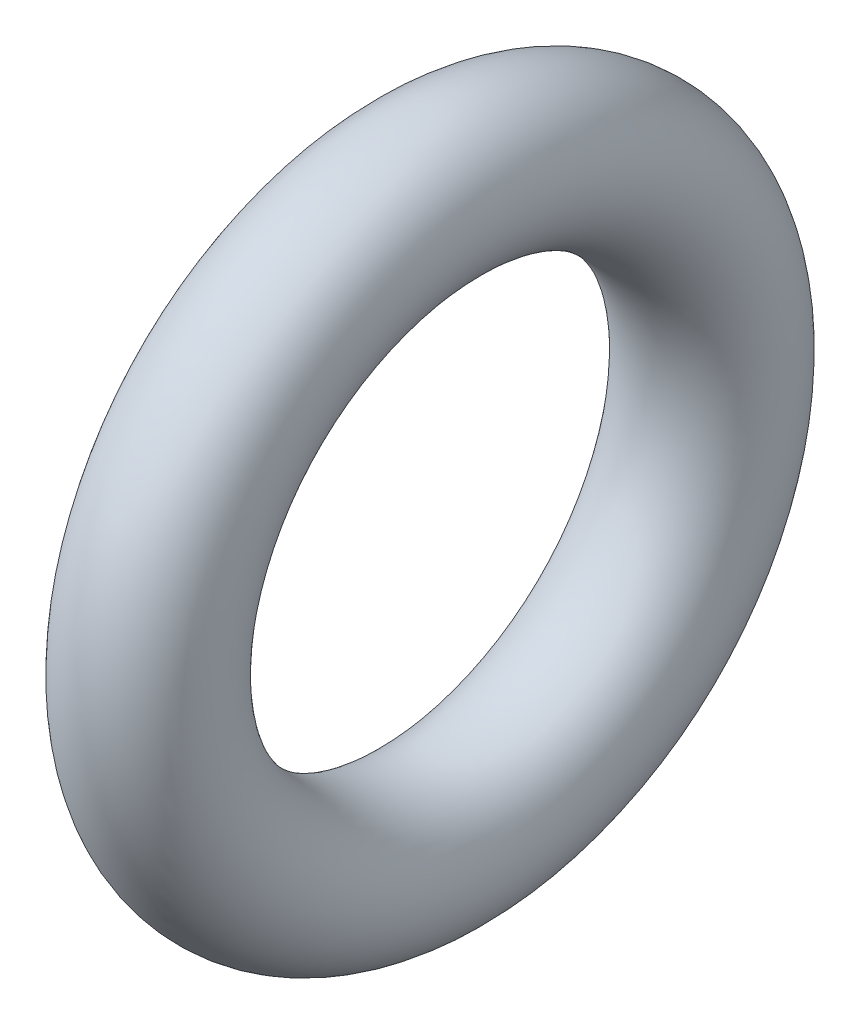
ISO-10303-21;
HEADER;
FILE_DESCRIPTION(('STEP AP214'),'2;1');
FILE_NAME('part.step','',(''),(''),'','','');
FILE_SCHEMA(('AUTOMOTIVE_DESIGN { 1 0 10303 214 1 1 1 1 }'));
ENDSEC;
DATA;
#1=APPLICATION_CONTEXT('core data for automotive mechanical design processes');
#2=APPLICATION_PROTOCOL_DEFINITION('international standard','automotive_design',2000,#1);
#3=PRODUCT_CONTEXT('',#1,'mechanical');
#4=PRODUCT('Part','Part','',(#3));
#5=PRODUCT_RELATED_PRODUCT_CATEGORY('part','',(#4));
#6=PRODUCT_DEFINITION_FORMATION('','',#4);
#7=PRODUCT_DEFINITION_CONTEXT('part definition',#1,'design');
#8=PRODUCT_DEFINITION('design','',#6,#7);
#9=PRODUCT_DEFINITION_SHAPE('','',#8);
#10=(LENGTH_UNIT() NAMED_UNIT(*) SI_UNIT(.MILLI.,.METRE.));
#11=(NAMED_UNIT(*) PLANE_ANGLE_UNIT() SI_UNIT($,.RADIAN.));
#12=(NAMED_UNIT(*) SI_UNIT($,.STERADIAN.) SOLID_ANGLE_UNIT());
#13=UNCERTAINTY_MEASURE_WITH_UNIT(LENGTH_MEASURE(1.E-05),#10,'distance_accuracy_value','');
#14=(GEOMETRIC_REPRESENTATION_CONTEXT(3) GLOBAL_UNCERTAINTY_ASSIGNED_CONTEXT((#13)) GLOBAL_UNIT_ASSIGNED_CONTEXT((#10,
#11,#12)) REPRESENTATION_CONTEXT('',''));
#15=CARTESIAN_POINT('',(0.,0.,0.));
#16=DIRECTION('',(0.,0.,1.));
#17=DIRECTION('',(1.,0.,0.));
#18=AXIS2_PLACEMENT_3D('',#15,#16,#17);
#19=CARTESIAN_POINT('',(5.5,0.,0.));
#20=DIRECTION('',(1.,0.,0.));
#21=DIRECTION('',(0.,-1.,0.));
#22=AXIS2_PLACEMENT_3D('',#19,#20,#21);
#23=TOROIDAL_SURFACE('',#22,12.975,3.33333333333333);
#24=CARTESIAN_POINT('',(5.5,-16.3083333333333,0.));
#25=VERTEX_POINT('',#24);
#26=VERTEX_LOOP('',#25);
#27=FACE_BOUND('',#26,.T.);
#28=ADVANCED_FACE('F12',(#27),#23,.T.);
#29=CLOSED_SHELL('',(#28));
#30=MANIFOLD_SOLID_BREP('B1',#29);
#31=ADVANCED_BREP_SHAPE_REPRESENTATION('',(#18,#30),#14);
#32=SHAPE_DEFINITION_REPRESENTATION(#9,#31);
ENDSEC;
END-ISO-10303-21;
